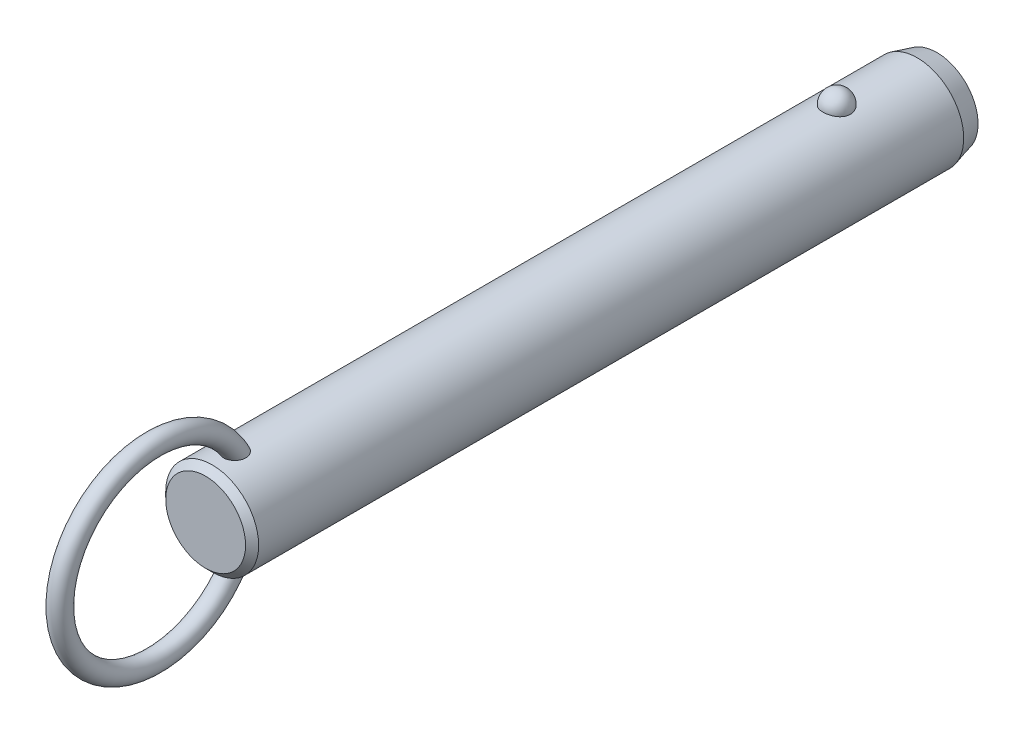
ISO-10303-21;
HEADER;
FILE_DESCRIPTION(('STEP AP214'),'2;1');
FILE_NAME('part.step','',(''),(''),'','','');
FILE_SCHEMA(('AUTOMOTIVE_DESIGN { 1 0 10303 214 1 1 1 1 }'));
ENDSEC;
DATA;
#1=APPLICATION_CONTEXT('core data for automotive mechanical design processes');
#2=APPLICATION_PROTOCOL_DEFINITION('international standard','automotive_design',2000,#1);
#3=PRODUCT_CONTEXT('',#1,'mechanical');
#4=PRODUCT('Part','Part','',(#3));
#5=PRODUCT_RELATED_PRODUCT_CATEGORY('part','',(#4));
#6=PRODUCT_DEFINITION_FORMATION('','',#4);
#7=PRODUCT_DEFINITION_CONTEXT('part definition',#1,'design');
#8=PRODUCT_DEFINITION('design','',#6,#7);
#9=PRODUCT_DEFINITION_SHAPE('','',#8);
#10=(LENGTH_UNIT() NAMED_UNIT(*) SI_UNIT(.MILLI.,.METRE.));
#11=(NAMED_UNIT(*) PLANE_ANGLE_UNIT() SI_UNIT($,.RADIAN.));
#12=(NAMED_UNIT(*) SI_UNIT($,.STERADIAN.) SOLID_ANGLE_UNIT());
#13=UNCERTAINTY_MEASURE_WITH_UNIT(LENGTH_MEASURE(1.E-05),#10,'distance_accuracy_value','');
#14=(GEOMETRIC_REPRESENTATION_CONTEXT(3) GLOBAL_UNCERTAINTY_ASSIGNED_CONTEXT((#13)) GLOBAL_UNIT_ASSIGNED_CONTEXT((#10,
#11,#12)) REPRESENTATION_CONTEXT('',''));
#15=CARTESIAN_POINT('',(0.,0.,0.));
#16=DIRECTION('',(0.,0.,1.));
#17=DIRECTION('',(1.,0.,0.));
#18=AXIS2_PLACEMENT_3D('',#15,#16,#17);
#19=CARTESIAN_POINT('',(0.,0.,86.4));
#20=DIRECTION('',(0.,0.,-1.));
#21=DIRECTION('',(-1.,0.,0.));
#22=AXIS2_PLACEMENT_3D('',#19,#20,#21);
#23=CYLINDRICAL_SURFACE('',#22,7.1);
#24=CARTESIAN_POINT('',(2.0769088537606,6.78943661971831,-2.1));
#25=CARTESIAN_POINT('',(2.07690739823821,6.78943796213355,-1.98268154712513));
#26=CARTESIAN_POINT('',(2.06738130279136,6.79237331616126,-1.86534506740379));
#27=CARTESIAN_POINT('',(2.0295040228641,6.8037853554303,-1.63400788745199));
#28=CARTESIAN_POINT('',(2.00114757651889,6.81226358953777,-1.52000812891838));
#29=CARTESIAN_POINT('',(1.92632025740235,6.83379798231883,-1.29863433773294));
#30=CARTESIAN_POINT('',(1.87985726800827,6.84685214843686,-1.19125744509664));
#31=CARTESIAN_POINT('',(1.76995205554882,6.87608091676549,-0.986046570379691));
#32=CARTESIAN_POINT('',(1.70650980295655,6.8922555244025,-0.888212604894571));
#33=CARTESIAN_POINT('',(1.56381192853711,6.92602930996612,-0.704242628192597));
#34=CARTESIAN_POINT('',(1.4844714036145,6.94363582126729,-0.618173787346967));
#35=CARTESIAN_POINT('',(1.31221746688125,6.97823658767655,-0.460740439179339));
#36=CARTESIAN_POINT('',(1.21930409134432,6.99523084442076,-0.389375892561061));
#37=CARTESIAN_POINT('',(1.02268781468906,7.02666176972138,-0.263547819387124));
#38=CARTESIAN_POINT('',(0.919020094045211,7.04110638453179,-0.209031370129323));
#39=CARTESIAN_POINT('',(0.703548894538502,7.06588726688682,-0.118163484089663));
#40=CARTESIAN_POINT('',(0.591746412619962,7.07622403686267,-0.0818098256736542));
#41=CARTESIAN_POINT('',(0.365557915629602,7.09147068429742,-0.028871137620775));
#42=CARTESIAN_POINT('',(0.251267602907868,7.09648447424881,-0.0119070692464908));
#43=CARTESIAN_POINT('',(0.0213499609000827,7.10089837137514,0.00304925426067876));
#44=CARTESIAN_POINT('',(-0.0942772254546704,7.10029907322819,0.00104351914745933));
#45=CARTESIAN_POINT('',(-0.321651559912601,7.09360829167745,-0.0216931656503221));
#46=CARTESIAN_POINT('',(-0.433431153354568,7.08760388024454,-0.0421272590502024));
#47=CARTESIAN_POINT('',(-0.651862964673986,7.07086131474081,-0.100729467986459));
#48=CARTESIAN_POINT('',(-0.758515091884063,7.06012307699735,-0.138897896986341));
#49=CARTESIAN_POINT('',(-0.964449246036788,7.03496097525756,-0.232213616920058));
#50=CARTESIAN_POINT('',(-1.06368095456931,7.02051445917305,-0.287465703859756));
#51=CARTESIAN_POINT('',(-1.25145353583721,6.98948740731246,-0.413383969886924));
#52=CARTESIAN_POINT('',(-1.33999321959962,6.97290663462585,-0.484051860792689));
#53=CARTESIAN_POINT('',(-1.50591604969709,6.93898770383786,-0.640594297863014));
#54=CARTESIAN_POINT('',(-1.58302488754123,6.92164094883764,-0.726757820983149));
#55=CARTESIAN_POINT('',(-1.72189320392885,6.8884103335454,-0.910927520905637));
#56=CARTESIAN_POINT('',(-1.78365144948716,6.87252659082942,-1.008934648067));
#57=CARTESIAN_POINT('',(-1.89101272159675,6.84377189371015,-1.21549497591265));
#58=CARTESIAN_POINT('',(-1.93639553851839,6.83094274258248,-1.32416860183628));
#59=CARTESIAN_POINT('',(-2.00874275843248,6.81002070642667,-1.54791500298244));
#60=CARTESIAN_POINT('',(-2.03570774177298,6.80192767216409,-1.66298757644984));
#61=CARTESIAN_POINT('',(-2.07047276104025,6.7914266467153,-1.89571453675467));
#62=CARTESIAN_POINT('',(-2.07835878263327,6.78899315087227,-2.01335491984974));
#63=CARTESIAN_POINT('',(-2.07502083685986,6.79001409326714,-2.24833570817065));
#64=CARTESIAN_POINT('',(-2.06379746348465,6.7934683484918,-2.36567612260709));
#65=CARTESIAN_POINT('',(-2.02263913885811,6.80583442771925,-2.59603194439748));
#66=CARTESIAN_POINT('',(-1.99281127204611,6.81471501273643,-2.70906820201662));
#67=CARTESIAN_POINT('',(-1.91526639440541,6.83691232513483,-2.92836575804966));
#68=CARTESIAN_POINT('',(-1.8675486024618,6.85022924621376,-3.03462676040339));
#69=CARTESIAN_POINT('',(-1.75504492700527,6.87991336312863,-3.23806487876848));
#70=CARTESIAN_POINT('',(-1.69015924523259,6.89629822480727,-3.33518422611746));
#71=CARTESIAN_POINT('',(-1.54505404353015,6.93024852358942,-3.51697105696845));
#72=CARTESIAN_POINT('',(-1.46483385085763,6.94781401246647,-3.60163799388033));
#73=CARTESIAN_POINT('',(-1.29071406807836,6.98225977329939,-3.75654119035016));
#74=CARTESIAN_POINT('',(-1.19675650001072,6.99913673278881,-3.82671308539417));
#75=CARTESIAN_POINT('',(-0.997940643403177,7.03023618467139,-3.9501837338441));
#76=CARTESIAN_POINT('',(-0.893083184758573,7.04445887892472,-4.00348377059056));
#77=CARTESIAN_POINT('',(-0.676902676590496,7.06848365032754,-4.09107242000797));
#78=CARTESIAN_POINT('',(-0.565686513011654,7.0783430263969,-4.12560889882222));
#79=CARTESIAN_POINT('',(-0.338739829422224,7.09282534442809,-4.17575450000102));
#80=CARTESIAN_POINT('',(-0.223009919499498,7.09744899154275,-4.19136617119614));
#81=CARTESIAN_POINT('',(0.00707628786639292,7.10090930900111,-4.20307965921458));
#82=CARTESIAN_POINT('',(0.121410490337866,7.09986531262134,-4.19958377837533));
#83=CARTESIAN_POINT('',(0.34781544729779,7.092380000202,-4.17411564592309));
#84=CARTESIAN_POINT('',(0.459886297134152,7.08593891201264,-4.15214417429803));
#85=CARTESIAN_POINT('',(0.678084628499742,7.06838983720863,-4.09049562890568));
#86=CARTESIAN_POINT('',(0.784237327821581,7.05730369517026,-4.05090137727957));
#87=CARTESIAN_POINT('',(0.988305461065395,7.03163139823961,-3.95511447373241));
#88=CARTESIAN_POINT('',(1.08622031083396,7.01704499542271,-3.89892064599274));
#89=CARTESIAN_POINT('',(1.27284490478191,6.98562668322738,-3.77035541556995));
#90=CARTESIAN_POINT('',(1.36137372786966,6.96876135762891,-3.69772964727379));
#91=CARTESIAN_POINT('',(1.52509486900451,6.93477412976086,-3.53878279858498));
#92=CARTESIAN_POINT('',(1.60028496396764,6.91765218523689,-3.45245943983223));
#93=CARTESIAN_POINT('',(1.73681688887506,6.88465753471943,-3.26658774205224));
#94=CARTESIAN_POINT('',(1.79785966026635,6.86881574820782,-3.16681408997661));
#95=CARTESIAN_POINT('',(1.90265327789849,6.84053157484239,-2.95814408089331));
#96=CARTESIAN_POINT('',(1.94640861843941,6.82808830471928,-2.84925010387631));
#97=CARTESIAN_POINT('',(2.01274378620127,6.80881460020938,-2.63454318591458));
#98=CARTESIAN_POINT('',(2.03676193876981,6.80160856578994,-2.52920574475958));
#99=CARTESIAN_POINT('',(2.06884490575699,6.79191902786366,-2.3159172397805));
#100=CARTESIAN_POINT('',(2.07691019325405,6.78943538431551,-2.20796625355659));
#101=CARTESIAN_POINT('',(2.0769088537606,6.78943661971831,-2.1));
#102=B_SPLINE_CURVE_WITH_KNOTS('',3,(#24,#25,#26,#27,#28,#29,#30,#31,#32,#33,#34,#35,#36,#37,
#38,#39,#40,#41,#42,#43,#44,#45,#46,#47,#48,#49,#50,#51,#52,#53,#54,#55,#56,#57,#58,#59,#60,#61,
#62,#63,#64,#65,#66,#67,#68,#69,#70,#71,#72,#73,#74,#75,#76,#77,#78,#79,#80,#81,#82,#83,#84,#85,
#86,#87,#88,#89,#90,#91,#92,#93,#94,#95,#96,#97,#98,#99,#100,#101),.UNSPECIFIED.,.T.,.F.,(4,2,2,
2,2,2,2,2,2,2,2,2,2,2,2,2,2,2,2,2,2,2,2,2,2,2,2,2,2,2,2,2,2,2,2,2,2,2,4),(0.,0.351568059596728,
0.703234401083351,1.05474780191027,1.40626181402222,1.75970563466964,2.11314851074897,
2.4654696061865,2.81774759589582,3.16301449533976,3.50824481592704,3.84801136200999,
4.18778391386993,4.52968352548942,4.87162112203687,5.22076181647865,5.56993054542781,
5.92363364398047,6.27732559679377,6.62942052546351,6.98150450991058,7.33158042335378,
7.68167162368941,8.03384443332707,8.38603269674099,8.73975272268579,9.09344583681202,
9.44234545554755,9.79119807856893,10.1327344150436,10.4742563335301,10.8141898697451,
11.1541474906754,11.4997793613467,11.8454687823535,12.1979079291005,12.5502553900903,
12.8738073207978,13.1973496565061),.UNSPECIFIED.);
#103=CARTESIAN_POINT('',(2.0769088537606,6.78943661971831,-2.1));
#104=VERTEX_POINT('',#103);
#105=EDGE_CURVE('E41',#104,#104,#102,.T.);
#106=ORIENTED_EDGE('',*,*,#105,.T.);
#107=EDGE_LOOP('',(#106));
#108=FACE_BOUND('',#107,.T.);
#109=CARTESIAN_POINT('',(0.,0.,93.3200000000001));
#110=DIRECTION('',(0.,0.,1.));
#111=DIRECTION('',(1.,0.,0.));
#112=AXIS2_PLACEMENT_3D('',#109,#110,#111);
#113=CIRCLE('',#112,7.1);
#114=CARTESIAN_POINT('',(7.1,0.,93.3200000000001));
#115=VERTEX_POINT('',#114);
#116=EDGE_CURVE('E10',#115,#115,#113,.F.);
#117=ORIENTED_EDGE('',*,*,#116,.T.);
#118=EDGE_LOOP('',(#117));
#119=FACE_BOUND('',#118,.T.);
#120=CARTESIAN_POINT('',(-0.429539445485,-7.08699541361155,88.1429212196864));
#121=CARTESIAN_POINT('',(-0.508331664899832,-7.08221999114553,88.1668764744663));
#122=CARTESIAN_POINT('',(-0.58503984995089,-7.07624016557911,88.1974570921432));
#123=CARTESIAN_POINT('',(-0.732082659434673,-7.06254296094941,88.2710242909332));
#124=CARTESIAN_POINT('',(-0.802417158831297,-7.05482554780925,88.3140111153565));
#125=CARTESIAN_POINT('',(-0.934722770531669,-7.03851844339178,88.4111135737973));
#126=CARTESIAN_POINT('',(-0.99670020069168,-7.02992941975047,88.4652207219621));
#127=CARTESIAN_POINT('',(-1.11079942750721,-7.01280697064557,88.5829676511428));
#128=CARTESIAN_POINT('',(-1.16292136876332,-7.00427354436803,88.6466072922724));
#129=CARTESIAN_POINT('',(-1.25705660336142,-6.98799959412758,88.7826870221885));
#130=CARTESIAN_POINT('',(-1.2988803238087,-6.98027525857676,88.8552598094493));
#131=CARTESIAN_POINT('',(-1.37069920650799,-6.96652886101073,89.0061686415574));
#132=CARTESIAN_POINT('',(-1.40069157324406,-6.96050720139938,89.0845060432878));
#133=CARTESIAN_POINT('',(-1.45043507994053,-6.95031881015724,89.2501903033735));
#134=CARTESIAN_POINT('',(-1.46937115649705,-6.94630231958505,89.3377897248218));
#135=CARTESIAN_POINT('',(-1.49424917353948,-6.94099239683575,89.5148714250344));
#136=CARTESIAN_POINT('',(-1.50018601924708,-6.93970003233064,89.6043544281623));
#137=CARTESIAN_POINT('',(-1.49978214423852,-6.93978815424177,89.7940607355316));
#138=CARTESIAN_POINT('',(-1.49187639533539,-6.94150934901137,89.894279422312));
#139=CARTESIAN_POINT('',(-1.46177925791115,-6.94790814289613,90.0924798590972));
#140=CARTESIAN_POINT('',(-1.43957541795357,-6.95258831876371,90.190459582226));
#141=CARTESIAN_POINT('',(-1.37783293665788,-6.96510647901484,90.3953629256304));
#142=CARTESIAN_POINT('',(-1.33634073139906,-6.97328848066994,90.5016801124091));
#143=CARTESIAN_POINT('',(-1.23686994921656,-6.99161706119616,90.7061777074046));
#144=CARTESIAN_POINT('',(-1.17889192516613,-7.00176357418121,90.8043583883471));
#145=CARTESIAN_POINT('',(-1.0587512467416,-7.02082898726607,90.9723743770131));
#146=CARTESIAN_POINT('',(-0.999247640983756,-7.02963746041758,91.0441230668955));
#147=CARTESIAN_POINT('',(-0.869494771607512,-7.04686074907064,91.1771959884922));
#148=CARTESIAN_POINT('',(-0.799263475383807,-7.05527619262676,91.2385372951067));
#149=CARTESIAN_POINT('',(-0.665408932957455,-7.06899457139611,91.3351316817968));
#150=CARTESIAN_POINT('',(-0.603817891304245,-7.07457275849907,91.3731512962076));
#151=CARTESIAN_POINT('',(-0.47517283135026,-7.08437420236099,91.4387581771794));
#152=CARTESIAN_POINT('',(-0.408123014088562,-7.08859848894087,91.4663533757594));
#153=CARTESIAN_POINT('',(-0.269431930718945,-7.09522749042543,91.5092569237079));
#154=CARTESIAN_POINT('',(-0.197757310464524,-7.09761688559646,91.5244618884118));
#155=CARTESIAN_POINT('',(-0.0527849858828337,-7.10017268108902,91.5407168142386));
#156=CARTESIAN_POINT('',(0.0205115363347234,-7.10034065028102,91.5417767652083));
#157=CARTESIAN_POINT('',(0.15642613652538,-7.09855986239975,91.5304619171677));
#158=CARTESIAN_POINT('',(0.219199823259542,-7.09688191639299,91.5198060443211));
#159=CARTESIAN_POINT('',(0.342134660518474,-7.09201880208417,91.4885379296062));
#160=CARTESIAN_POINT('',(0.402295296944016,-7.08883333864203,91.4679237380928));
#161=CARTESIAN_POINT('',(0.520687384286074,-7.08113868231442,91.4172125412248));
#162=CARTESIAN_POINT('',(0.578791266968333,-7.07658958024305,91.3868272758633));
#163=CARTESIAN_POINT('',(0.690173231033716,-7.06659708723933,91.3183678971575));
#164=CARTESIAN_POINT('',(0.743447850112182,-7.061153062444,91.2802883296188));
#165=CARTESIAN_POINT('',(0.870947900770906,-7.04680292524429,91.1765929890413));
#166=CARTESIAN_POINT('',(0.9418289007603,-7.0375580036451,91.1068972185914));
#167=CARTESIAN_POINT('',(1.07136606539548,-7.01900793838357,90.9569450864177));
#168=CARTESIAN_POINT('',(1.13000013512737,-7.00970271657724,90.8766700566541));
#169=CARTESIAN_POINT('',(1.23579584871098,-6.99183327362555,90.7068997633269));
#170=CARTESIAN_POINT('',(1.2827427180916,-6.98328455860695,90.6172696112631));
#171=CARTESIAN_POINT('',(1.36351442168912,-6.96796352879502,90.4321763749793));
#172=CARTESIAN_POINT('',(1.39733971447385,-6.96119115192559,90.3367134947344));
#173=CARTESIAN_POINT('',(1.45579181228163,-6.94922464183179,90.1253092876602));
#174=CARTESIAN_POINT('',(1.47790145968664,-6.94449000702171,90.008631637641));
#175=CARTESIAN_POINT('',(1.50168752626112,-6.93938731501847,89.7730153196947));
#176=CARTESIAN_POINT('',(1.50336085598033,-6.93901991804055,89.6540763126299));
#177=CARTESIAN_POINT('',(1.48486516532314,-6.9430010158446,89.4236079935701));
#178=CARTESIAN_POINT('',(1.46573441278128,-6.9471253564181,89.3119958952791));
#179=CARTESIAN_POINT('',(1.40606892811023,-6.95944667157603,89.0948868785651));
#180=CARTESIAN_POINT('',(1.36556446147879,-6.96763788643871,88.9893815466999));
#181=CARTESIAN_POINT('',(1.27082700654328,-6.98548038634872,88.8042879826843));
#182=CARTESIAN_POINT('',(1.21949810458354,-6.99473841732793,88.7231719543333));
#183=CARTESIAN_POINT('',(1.10242050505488,-7.01414069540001,88.5722278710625));
#184=CARTESIAN_POINT('',(1.03668119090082,-7.02428436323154,88.5023925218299));
#185=CARTESIAN_POINT('',(0.900559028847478,-7.04295285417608,88.3835735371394));
#186=CARTESIAN_POINT('',(0.83142884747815,-7.05153466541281,88.3331573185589));
#187=CARTESIAN_POINT('',(0.68529187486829,-7.06723150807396,88.2451429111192));
#188=CARTESIAN_POINT('',(0.608287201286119,-7.0743469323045,88.2075412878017));
#189=CARTESIAN_POINT('',(0.451878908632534,-7.08602232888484,88.1474915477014));
#190=CARTESIAN_POINT('',(0.372686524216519,-7.09067127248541,88.1245088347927));
#191=CARTESIAN_POINT('',(0.211477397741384,-7.09730788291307,88.0920357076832));
#192=CARTESIAN_POINT('',(0.129460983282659,-7.09929585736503,88.0825437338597));
#193=CARTESIAN_POINT('',(-0.0332905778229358,-7.10037858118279,88.0773517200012));
#194=CARTESIAN_POINT('',(-0.114016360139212,-7.09953334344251,88.0813656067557));
#195=CARTESIAN_POINT('',(-0.273670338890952,-7.09517338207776,88.1024540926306));
#196=CARTESIAN_POINT('',(-0.352598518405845,-7.09165863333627,88.1195288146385));
#197=CARTESIAN_POINT('',(-0.429539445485,-7.08699541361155,88.1429212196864));
#198=B_SPLINE_CURVE_WITH_KNOTS('',3,(#120,#121,#122,#123,#124,#125,#126,#127,#128,#129,#130,
#131,#132,#133,#134,#135,#136,#137,#138,#139,#140,#141,#142,#143,#144,#145,#146,#147,#148,#149,
#150,#151,#152,#153,#154,#155,#156,#157,#158,#159,#160,#161,#162,#163,#164,#165,#166,#167,#168,
#169,#170,#171,#172,#173,#174,#175,#176,#177,#178,#179,#180,#181,#182,#183,#184,#185,#186,#187,
#188,#189,#190,#191,#192,#193,#194,#195,#196,#197),.UNSPECIFIED.,.T.,.F.,(4,2,2,2,2,2,2,2,2,2,2,
2,2,2,2,2,2,2,2,2,2,2,2,2,2,2,2,2,2,2,2,2,2,2,2,2,2,2,4),(0.,0.247183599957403,
0.494372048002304,0.741372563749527,0.988369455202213,1.23962059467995,1.49093106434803,
1.75897818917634,2.02713035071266,2.3275826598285,2.62829697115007,2.97008736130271,
3.31186629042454,3.59175319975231,3.87117637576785,4.08813841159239,4.30493502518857,
4.52352259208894,4.74195577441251,4.9321532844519,5.12238804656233,5.31884850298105,
5.51544871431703,5.81332317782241,6.11173048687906,6.41527266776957,6.71880423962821,
7.07358156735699,7.42841252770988,7.76631485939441,8.10373999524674,8.39142246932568,
8.67891817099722,8.93560332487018,9.19221962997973,9.43881106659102,9.68537399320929,
9.92674752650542,10.1681233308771),.UNSPECIFIED.);
#199=CARTESIAN_POINT('',(-0.429539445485,-7.08699541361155,88.1429212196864));
#200=VERTEX_POINT('',#199);
#201=EDGE_CURVE('E59',#200,#200,#198,.T.);
#202=ORIENTED_EDGE('',*,*,#201,.T.);
#203=EDGE_LOOP('',(#202));
#204=FACE_BOUND('',#203,.T.);
#205=CARTESIAN_POINT('',(-0.429539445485,7.08699541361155,88.1429212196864));
#206=CARTESIAN_POINT('',(-0.351665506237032,7.09171429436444,88.1192469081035));
#207=CARTESIAN_POINT('',(-0.271733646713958,7.09525896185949,88.1020369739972));
#208=CARTESIAN_POINT('',(-0.110026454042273,7.09960839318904,88.0810059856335));
#209=CARTESIAN_POINT('',(-0.0282502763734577,7.10041187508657,88.077191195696));
#210=CARTESIAN_POINT('',(0.134782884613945,7.09918849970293,88.083059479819));
#211=CARTESIAN_POINT('',(0.21603995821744,7.09716214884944,88.0927401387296));
#212=CARTESIAN_POINT('',(0.375730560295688,7.09050177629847,88.1253471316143));
#213=CARTESIAN_POINT('',(0.454164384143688,7.08586802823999,88.1482720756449));
#214=CARTESIAN_POINT('',(0.606025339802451,7.07449911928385,88.206771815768));
#215=CARTESIAN_POINT('',(0.679451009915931,7.06776334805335,88.2423502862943));
#216=CARTESIAN_POINT('',(0.819234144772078,7.05292866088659,88.3251753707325));
#217=CARTESIAN_POINT('',(0.885591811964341,7.04482978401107,88.3724216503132));
#218=CARTESIAN_POINT('',(1.00993211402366,7.02808709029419,88.4775902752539));
#219=CARTESIAN_POINT('',(1.06785399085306,7.01943990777,88.535583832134));
#220=CARTESIAN_POINT('',(1.17342527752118,7.00256662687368,88.6603013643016));
#221=CARTESIAN_POINT('',(1.22107408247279,6.99434055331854,88.7270258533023));
#222=CARTESIAN_POINT('',(1.30652927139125,6.97889183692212,88.8693622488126));
#223=CARTESIAN_POINT('',(1.34399711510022,6.97170674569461,88.9451808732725));
#224=CARTESIAN_POINT('',(1.40682616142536,6.95930080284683,89.1018100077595));
#225=CARTESIAN_POINT('',(1.43218374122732,6.95408053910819,89.1826220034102));
#226=CARTESIAN_POINT('',(1.47246409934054,6.94566853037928,89.3535314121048));
#227=CARTESIAN_POINT('',(1.48642590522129,6.9426653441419,89.4438630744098));
#228=CARTESIAN_POINT('',(1.5011410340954,6.93949744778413,89.625619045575));
#229=CARTESIAN_POINT('',(1.50188917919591,6.93933385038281,89.7170437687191));
#230=CARTESIAN_POINT('',(1.49030464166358,6.94183245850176,89.9108438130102));
#231=CARTESIAN_POINT('',(1.47627413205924,6.94486147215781,90.013112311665));
#232=CARTESIAN_POINT('',(1.43356351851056,6.95380194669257,90.2144719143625));
#233=CARTESIAN_POINT('',(1.4048676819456,6.95971650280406,90.3135594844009));
#234=CARTESIAN_POINT('',(1.32908750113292,6.97461208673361,90.5189087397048));
#235=CARTESIAN_POINT('',(1.28011435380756,6.98388945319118,90.6244566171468));
#236=CARTESIAN_POINT('',(1.16520357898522,7.00397743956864,90.8257604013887));
#237=CARTESIAN_POINT('',(1.09927694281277,7.01478706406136,90.9215225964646));
#238=CARTESIAN_POINT('',(0.969361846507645,7.03373936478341,91.0767565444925));
#239=CARTESIAN_POINT('',(0.909042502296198,7.04187023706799,91.1393032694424));
#240=CARTESIAN_POINT('',(0.77917855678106,7.0574173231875,91.2540535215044));
#241=CARTESIAN_POINT('',(0.70964977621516,7.06483472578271,91.3062744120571));
#242=CARTESIAN_POINT('',(0.576854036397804,7.0767751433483,91.3881138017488));
#243=CARTESIAN_POINT('',(0.515118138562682,7.08158033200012,91.4201641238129));
#244=CARTESIAN_POINT('',(0.387127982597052,7.08972701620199,91.4737656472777));
#245=CARTESIAN_POINT('',(0.320877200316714,7.09306962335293,91.4953248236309));
#246=CARTESIAN_POINT('',(0.185041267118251,7.09791507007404,91.5264005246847));
#247=CARTESIAN_POINT('',(0.115437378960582,7.09940591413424,91.5358385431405));
#248=CARTESIAN_POINT('',(-0.0243157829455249,7.10030171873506,91.5415226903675));
#249=CARTESIAN_POINT('',(-0.0944648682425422,7.0997073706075,91.5377731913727));
#250=CARTESIAN_POINT('',(-0.225713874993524,7.09668414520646,91.5185081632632));
#251=CARTESIAN_POINT('',(-0.287006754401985,7.09444865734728,91.5042323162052));
#252=CARTESIAN_POINT('',(-0.406555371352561,7.08860360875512,91.4663685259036));
#253=CARTESIAN_POINT('',(-0.464809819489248,7.08499346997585,91.4427766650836));
#254=CARTESIAN_POINT('',(-0.594955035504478,7.07541654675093,91.3789232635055));
#255=CARTESIAN_POINT('',(-0.665389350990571,7.06906574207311,91.335753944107));
#256=CARTESIAN_POINT('',(-0.798242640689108,7.05530261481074,91.238587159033));
#257=CARTESIAN_POINT('',(-0.860645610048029,7.0478882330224,91.1845686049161));
#258=CARTESIAN_POINT('',(-0.994249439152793,7.03045217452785,91.0509965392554));
#259=CARTESIAN_POINT('',(-1.06260129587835,7.02030745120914,90.9686143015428));
#260=CARTESIAN_POINT('',(-1.18502045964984,7.00068382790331,90.793843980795));
#261=CARTESIAN_POINT('',(-1.23907684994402,6.99120544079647,90.701448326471));
#262=CARTESIAN_POINT('',(-1.33335589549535,6.97384343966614,90.5080085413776));
#263=CARTESIAN_POINT('',(-1.37336138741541,6.96598557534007,90.4068564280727));
#264=CARTESIAN_POINT('',(-1.43770677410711,6.9529905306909,90.1995046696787));
#265=CARTESIAN_POINT('',(-1.46204473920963,6.94785368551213,90.09330440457));
#266=CARTESIAN_POINT('',(-1.49537533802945,6.94076296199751,89.8682317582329));
#267=CARTESIAN_POINT('',(-1.50273564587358,6.93914842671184,89.74909751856));
#268=CARTESIAN_POINT('',(-1.4954555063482,6.94072368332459,89.5114703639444));
#269=CARTESIAN_POINT('',(-1.48082914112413,6.94391040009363,89.3929770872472));
#270=CARTESIAN_POINT('',(-1.43076401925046,6.95438579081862,89.1734325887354));
#271=CARTESIAN_POINT('',(-1.39762227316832,6.96121852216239,89.0718413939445));
#272=CARTESIAN_POINT('',(-1.31211274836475,6.97783941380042,88.8773513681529));
#273=CARTESIAN_POINT('',(-1.25976607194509,6.98762432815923,88.7844431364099));
#274=CARTESIAN_POINT('',(-1.14583073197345,7.00713153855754,88.6241601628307));
#275=CARTESIAN_POINT('',(-1.0866594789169,7.01665982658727,88.5550351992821));
#276=CARTESIAN_POINT('',(-0.956606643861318,7.03556646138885,88.4288786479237));
#277=CARTESIAN_POINT('',(-0.885737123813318,7.04494495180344,88.3718347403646));
#278=CARTESIAN_POINT('',(-0.751558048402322,7.06035735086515,88.2831004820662));
#279=CARTESIAN_POINT('',(-0.690120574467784,7.0666695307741,88.2485932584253));
#280=CARTESIAN_POINT('',(-0.562815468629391,7.07794609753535,88.1887507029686));
#281=CARTESIAN_POINT('',(-0.496948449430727,7.08291067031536,88.1634141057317));
#282=CARTESIAN_POINT('',(-0.429539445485,7.08699541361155,88.1429212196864));
#283=B_SPLINE_CURVE_WITH_KNOTS('',3,(#205,#206,#207,#208,#209,#210,#211,#212,#213,#214,#215,
#216,#217,#218,#219,#220,#221,#222,#223,#224,#225,#226,#227,#228,#229,#230,#231,#232,#233,#234,
#235,#236,#237,#238,#239,#240,#241,#242,#243,#244,#245,#246,#247,#248,#249,#250,#251,#252,#253,
#254,#255,#256,#257,#258,#259,#260,#261,#262,#263,#264,#265,#266,#267,#268,#269,#270,#271,#272,
#273,#274,#275,#276,#277,#278,#279,#280,#281,#282),.UNSPECIFIED.,.T.,.F.,(4,2,2,2,2,2,2,2,2,2,2,
2,2,2,2,2,2,2,2,2,2,2,2,2,2,2,2,2,2,2,2,2,2,2,2,2,2,2,4),(0.,0.244335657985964,
0.488785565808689,0.73319173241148,0.977572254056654,1.22202379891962,1.46646834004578,
1.71259457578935,1.95873529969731,2.21226768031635,2.46587585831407,2.7391381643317,
3.01250754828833,3.32109936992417,3.63002293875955,3.97863512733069,4.32702187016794,
4.5879394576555,4.84841449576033,5.05676704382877,5.26496096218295,5.47449661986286,
5.68396281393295,5.8720544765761,6.06022532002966,6.30743751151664,6.55513496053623,
6.87602468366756,7.19715875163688,7.52305774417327,7.84899686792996,8.20516155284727,
8.56109821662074,8.88040084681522,9.19935367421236,9.47236282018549,9.74509220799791,
9.95662250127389,10.1681235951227),.UNSPECIFIED.);
#284=CARTESIAN_POINT('',(-0.429539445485,7.08699541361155,88.1429212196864));
#285=VERTEX_POINT('',#284);
#286=EDGE_CURVE('E67',#285,#285,#283,.T.);
#287=ORIENTED_EDGE('',*,*,#286,.T.);
#288=EDGE_LOOP('',(#287));
#289=FACE_BOUND('',#288,.T.);
#290=CARTESIAN_POINT('',(0.,0.,-14.4000000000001));
#291=DIRECTION('',(0.,0.,-1.));
#292=DIRECTION('',(-1.,0.,0.));
#293=AXIS2_PLACEMENT_3D('',#290,#291,#292);
#294=CIRCLE('',#293,7.1);
#295=CARTESIAN_POINT('',(-7.1,0.,-14.4000000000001));
#296=VERTEX_POINT('',#295);
#297=EDGE_CURVE('E56',#296,#296,#294,.F.);
#298=ORIENTED_EDGE('',*,*,#297,.T.);
#299=EDGE_LOOP('',(#298));
#300=FACE_BOUND('',#299,.T.);
#301=ADVANCED_FACE('F37',(#108,#119,#204,#289,#300),#23,.T.);
#302=CARTESIAN_POINT('',(0.,0.,-17.4));
#303=DIRECTION('',(0.,0.,-1.));
#304=DIRECTION('',(-1.,0.,0.));
#305=AXIS2_PLACEMENT_3D('',#302,#303,#304);
#306=PLANE('',#305);
#307=CARTESIAN_POINT('',(0.,0.,-17.4));
#308=DIRECTION('',(0.,0.,-1.));
#309=DIRECTION('',(-1.,0.,0.));
#310=AXIS2_PLACEMENT_3D('',#307,#308,#309);
#311=CIRCLE('',#310,6.29615242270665);
#312=CARTESIAN_POINT('',(-6.29615242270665,0.,-17.4));
#313=VERTEX_POINT('',#312);
#314=EDGE_CURVE('E66',#313,#313,#311,.T.);
#315=ORIENTED_EDGE('',*,*,#314,.T.);
#316=EDGE_LOOP('',(#315));
#317=FACE_BOUND('',#316,.T.);
#318=ADVANCED_FACE('F85',(#317),#306,.T.);
#319=CARTESIAN_POINT('',(0.,0.,-17.4));
#320=DIRECTION('',(0.,0.,1.));
#321=DIRECTION('',(1.,0.,0.));
#322=AXIS2_PLACEMENT_3D('',#319,#320,#321);
#323=CONICAL_SURFACE('',#322,6.29615242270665,0.26179938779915);
#324=ORIENTED_EDGE('',*,*,#297,.F.);
#325=EDGE_LOOP('',(#324));
#326=FACE_BOUND('',#325,.T.);
#327=ORIENTED_EDGE('',*,*,#314,.F.);
#328=EDGE_LOOP('',(#327));
#329=FACE_BOUND('',#328,.T.);
#330=ADVANCED_FACE('F83',(#326,#329),#323,.T.);
#331=CARTESIAN_POINT('',(0.,0.,94.32));
#332=DIRECTION('',(0.,0.,1.));
#333=DIRECTION('',(1.,0.,0.));
#334=AXIS2_PLACEMENT_3D('',#331,#332,#333);
#335=PLANE('',#334);
#336=CARTESIAN_POINT('',(0.,0.,94.32));
#337=DIRECTION('',(0.,0.,1.));
#338=DIRECTION('',(1.,0.,0.));
#339=AXIS2_PLACEMENT_3D('',#336,#337,#338);
#340=CIRCLE('',#339,6.10000000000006);
#341=CARTESIAN_POINT('',(6.10000000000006,0.,94.32));
#342=VERTEX_POINT('',#341);
#343=EDGE_CURVE('E50',#342,#342,#340,.T.);
#344=ORIENTED_EDGE('',*,*,#343,.T.);
#345=EDGE_LOOP('',(#344));
#346=FACE_BOUND('',#345,.T.);
#347=ADVANCED_FACE('F77',(#346),#335,.T.);
#348=CARTESIAN_POINT('',(0.,0.,102.25));
#349=DIRECTION('',(1.,0.,0.));
#350=DIRECTION('',(0.,0.,-1.));
#351=AXIS2_PLACEMENT_3D('',#348,#349,#350);
#352=TOROIDAL_SURFACE('',#351,14.35,1.5);
#353=ORIENTED_EDGE('',*,*,#286,.F.);
#354=EDGE_LOOP('',(#353));
#355=FACE_BOUND('',#354,.T.);
#356=ORIENTED_EDGE('',*,*,#201,.F.);
#357=EDGE_LOOP('',(#356));
#358=FACE_BOUND('',#357,.T.);
#359=ADVANCED_FACE('F73',(#355,#358),#352,.T.);
#360=CARTESIAN_POINT('',(0.,0.,94.32));
#361=DIRECTION('',(0.,0.,-1.));
#362=DIRECTION('',(-1.,0.,0.));
#363=AXIS2_PLACEMENT_3D('',#360,#361,#362);
#364=CONICAL_SURFACE('',#363,6.10000000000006,0.785398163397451);
#365=ORIENTED_EDGE('',*,*,#116,.F.);
#366=EDGE_LOOP('',(#365));
#367=FACE_BOUND('',#366,.T.);
#368=ORIENTED_EDGE('',*,*,#343,.F.);
#369=EDGE_LOOP('',(#368));
#370=FACE_BOUND('',#369,.T.);
#371=ADVANCED_FACE('F39',(#367,#370),#364,.T.);
#372=CARTESIAN_POINT('',(0.,7.1,-2.1));
#373=DIRECTION('',(0.,1.,0.));
#374=DIRECTION('',(0.,0.,1.));
#375=AXIS2_PLACEMENT_3D('',#372,#373,#374);
#376=SPHERICAL_SURFACE('',#375,2.10000000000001);
#377=ORIENTED_EDGE('',*,*,#105,.F.);
#378=EDGE_LOOP('',(#377));
#379=FACE_BOUND('',#378,.T.);
#380=ADVANCED_FACE('F79',(#379),#376,.T.);
#381=CLOSED_SHELL('',(#301,#318,#330,#347,#359,#371,#380));
#382=MANIFOLD_SOLID_BREP('B2',#381);
#383=ADVANCED_BREP_SHAPE_REPRESENTATION('',(#18,#382),#14);
#384=SHAPE_DEFINITION_REPRESENTATION(#9,#383);
ENDSEC;
END-ISO-10303-21;
